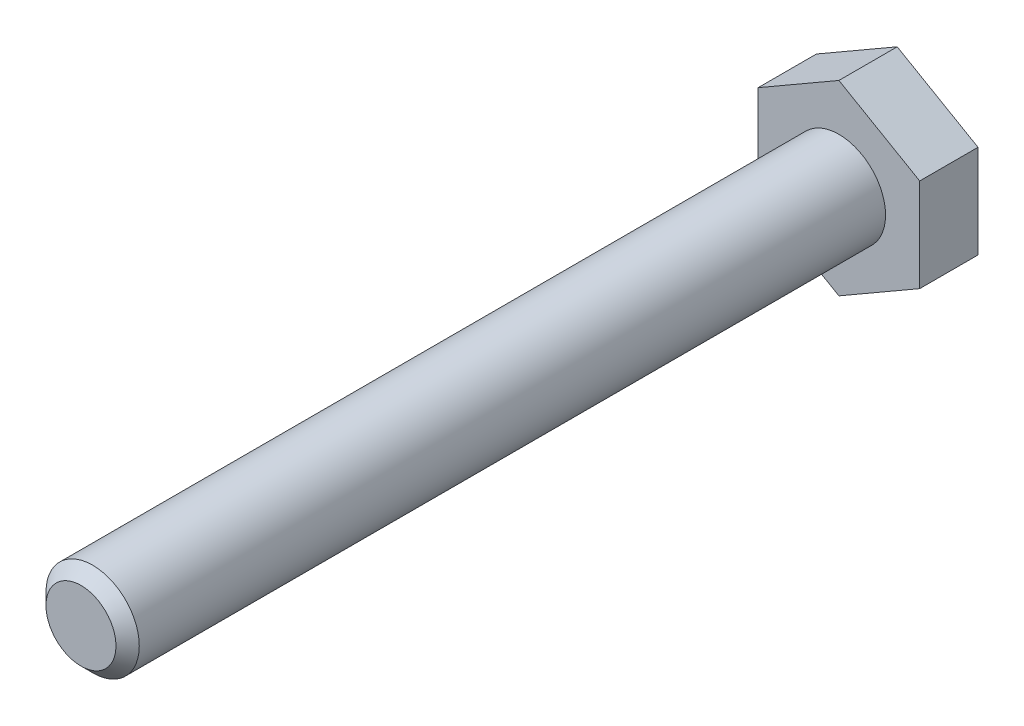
ISO-10303-21;
HEADER;
FILE_DESCRIPTION(('STEP AP214'),'2;1');
FILE_NAME('part.step','',(''),(''),'','','');
FILE_SCHEMA(('AUTOMOTIVE_DESIGN { 1 0 10303 214 1 1 1 1 }'));
ENDSEC;
DATA;
#1=APPLICATION_CONTEXT('core data for automotive mechanical design processes');
#2=APPLICATION_PROTOCOL_DEFINITION('international standard','automotive_design',2000,#1);
#3=PRODUCT_CONTEXT('',#1,'mechanical');
#4=PRODUCT('Part','Part','',(#3));
#5=PRODUCT_RELATED_PRODUCT_CATEGORY('part','',(#4));
#6=PRODUCT_DEFINITION_FORMATION('','',#4);
#7=PRODUCT_DEFINITION_CONTEXT('part definition',#1,'design');
#8=PRODUCT_DEFINITION('design','',#6,#7);
#9=PRODUCT_DEFINITION_SHAPE('','',#8);
#10=(LENGTH_UNIT() NAMED_UNIT(*) SI_UNIT(.MILLI.,.METRE.));
#11=(NAMED_UNIT(*) PLANE_ANGLE_UNIT() SI_UNIT($,.RADIAN.));
#12=(NAMED_UNIT(*) SI_UNIT($,.STERADIAN.) SOLID_ANGLE_UNIT());
#13=UNCERTAINTY_MEASURE_WITH_UNIT(LENGTH_MEASURE(1.E-05),#10,'distance_accuracy_value','');
#14=(GEOMETRIC_REPRESENTATION_CONTEXT(3) GLOBAL_UNCERTAINTY_ASSIGNED_CONTEXT((#13)) GLOBAL_UNIT_ASSIGNED_CONTEXT((#10,
#11,#12)) REPRESENTATION_CONTEXT('',''));
#15=CARTESIAN_POINT('',(0.,0.,0.));
#16=DIRECTION('',(0.,0.,1.));
#17=DIRECTION('',(1.,0.,0.));
#18=AXIS2_PLACEMENT_3D('',#15,#16,#17);
#19=CARTESIAN_POINT('',(6.92820323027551,4.00000000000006,70.));
#20=DIRECTION('',(-0.5,-0.866025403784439,0.));
#21=DIRECTION('',(0.866025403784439,-0.5,0.));
#22=AXIS2_PLACEMENT_3D('',#19,#20,#21);
#23=PLANE('',#22);
#24=DIRECTION('',(-0.866025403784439,0.5,0.));
#25=VECTOR('',#24,1.);
#26=CARTESIAN_POINT('',(6.92820323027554,3.99999999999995,5.00000000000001));
#27=LINE('',#26,#25);
#28=CARTESIAN_POINT('',(6.92820323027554,3.99999999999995,5.00000000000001));
#29=VERTEX_POINT('',#28);
#30=CARTESIAN_POINT('',(0.,8.00000000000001,5.00000000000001));
#31=VERTEX_POINT('',#30);
#32=EDGE_CURVE('E79',#29,#31,#27,.T.);
#33=ORIENTED_EDGE('',*,*,#32,.F.);
#34=DIRECTION('',(0.,0.,-1.));
#35=VECTOR('',#34,1.);
#36=CARTESIAN_POINT('',(6.92820323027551,4.00000000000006,70.));
#37=LINE('',#36,#35);
#38=CARTESIAN_POINT('',(6.92820323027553,3.99999999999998,0.));
#39=VERTEX_POINT('',#38);
#40=EDGE_CURVE('E48',#29,#39,#37,.T.);
#41=ORIENTED_EDGE('',*,*,#40,.T.);
#42=DIRECTION('',(-0.866025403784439,0.5,0.));
#43=VECTOR('',#42,1.);
#44=CARTESIAN_POINT('',(6.92820323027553,3.99999999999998,0.));
#45=LINE('',#44,#43);
#46=CARTESIAN_POINT('',(0.,8.00000000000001,0.));
#47=VERTEX_POINT('',#46);
#48=EDGE_CURVE('E86',#39,#47,#45,.T.);
#49=ORIENTED_EDGE('',*,*,#48,.T.);
#50=DIRECTION('',(0.,0.,-1.));
#51=VECTOR('',#50,1.);
#52=CARTESIAN_POINT('',(0.,8.00000000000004,70.));
#53=LINE('',#52,#51);
#54=EDGE_CURVE('E83',#31,#47,#53,.T.);
#55=ORIENTED_EDGE('',*,*,#54,.F.);
#56=EDGE_LOOP('',(#33,#41,#49,#55));
#57=FACE_BOUND('',#56,.T.);
#58=ADVANCED_FACE('F26',(#57),#23,.F.);
#59=CARTESIAN_POINT('',(0.,8.00000000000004,70.));
#60=DIRECTION('',(0.5,-0.866025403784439,0.));
#61=DIRECTION('',(0.866025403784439,0.5,0.));
#62=AXIS2_PLACEMENT_3D('',#59,#60,#61);
#63=PLANE('',#62);
#64=DIRECTION('',(-0.866025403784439,-0.5,0.));
#65=VECTOR('',#64,1.);
#66=CARTESIAN_POINT('',(0.,8.00000000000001,5.00000000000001));
#67=LINE('',#66,#65);
#68=CARTESIAN_POINT('',(-6.92820323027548,3.99999999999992,5.00000000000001));
#69=VERTEX_POINT('',#68);
#70=EDGE_CURVE('E87',#31,#69,#67,.T.);
#71=ORIENTED_EDGE('',*,*,#70,.F.);
#72=ORIENTED_EDGE('',*,*,#54,.T.);
#73=DIRECTION('',(-0.866025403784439,-0.5,0.));
#74=VECTOR('',#73,1.);
#75=CARTESIAN_POINT('',(0.,8.00000000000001,0.));
#76=LINE('',#75,#74);
#77=CARTESIAN_POINT('',(-6.92820323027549,3.99999999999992,0.));
#78=VERTEX_POINT('',#77);
#79=EDGE_CURVE('E168',#47,#78,#76,.T.);
#80=ORIENTED_EDGE('',*,*,#79,.T.);
#81=DIRECTION('',(0.,0.,-1.));
#82=VECTOR('',#81,1.);
#83=CARTESIAN_POINT('',(-6.92820323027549,3.99999999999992,70.));
#84=LINE('',#83,#82);
#85=EDGE_CURVE('E104',#69,#78,#84,.T.);
#86=ORIENTED_EDGE('',*,*,#85,.F.);
#87=EDGE_LOOP('',(#71,#72,#80,#86));
#88=FACE_BOUND('',#87,.T.);
#89=ADVANCED_FACE('F124',(#88),#63,.F.);
#90=CARTESIAN_POINT('',(-6.92820323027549,3.99999999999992,70.));
#91=DIRECTION('',(1.,0.,0.));
#92=DIRECTION('',(0.,1.,0.));
#93=AXIS2_PLACEMENT_3D('',#90,#91,#92);
#94=PLANE('',#93);
#95=DIRECTION('',(0.,-1.,0.));
#96=VECTOR('',#95,1.);
#97=CARTESIAN_POINT('',(-6.92820323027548,3.99999999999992,5.00000000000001));
#98=LINE('',#97,#96);
#99=CARTESIAN_POINT('',(-6.9282032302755,-4.00000000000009,5.00000000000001));
#100=VERTEX_POINT('',#99);
#101=EDGE_CURVE('E164',#69,#100,#98,.T.);
#102=ORIENTED_EDGE('',*,*,#101,.F.);
#103=ORIENTED_EDGE('',*,*,#85,.T.);
#104=DIRECTION('',(0.,-1.,0.));
#105=VECTOR('',#104,1.);
#106=CARTESIAN_POINT('',(-6.92820323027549,3.99999999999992,0.));
#107=LINE('',#106,#105);
#108=CARTESIAN_POINT('',(-6.92820323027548,-4.,0.));
#109=VERTEX_POINT('',#108);
#110=EDGE_CURVE('E171',#78,#109,#107,.T.);
#111=ORIENTED_EDGE('',*,*,#110,.T.);
#112=DIRECTION('',(0.,0.,-1.));
#113=VECTOR('',#112,1.);
#114=CARTESIAN_POINT('',(-6.92820323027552,-4.00000000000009,70.));
#115=LINE('',#114,#113);
#116=EDGE_CURVE('E102',#100,#109,#115,.T.);
#117=ORIENTED_EDGE('',*,*,#116,.F.);
#118=EDGE_LOOP('',(#102,#103,#111,#117));
#119=FACE_BOUND('',#118,.T.);
#120=ADVANCED_FACE('F129',(#119),#94,.F.);
#121=CARTESIAN_POINT('',(-6.92820323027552,-4.00000000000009,70.));
#122=DIRECTION('',(0.5,0.866025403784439,0.));
#123=DIRECTION('',(-0.866025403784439,0.5,0.));
#124=AXIS2_PLACEMENT_3D('',#121,#122,#123);
#125=PLANE('',#124);
#126=DIRECTION('',(0.866025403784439,-0.5,0.));
#127=VECTOR('',#126,1.);
#128=CARTESIAN_POINT('',(-6.9282032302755,-4.00000000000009,5.00000000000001));
#129=LINE('',#128,#127);
#130=CARTESIAN_POINT('',(0.,-8.00000000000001,5.));
#131=VERTEX_POINT('',#130);
#132=EDGE_CURVE('E160',#100,#131,#129,.T.);
#133=ORIENTED_EDGE('',*,*,#132,.F.);
#134=ORIENTED_EDGE('',*,*,#116,.T.);
#135=DIRECTION('',(0.866025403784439,-0.5,0.));
#136=VECTOR('',#135,1.);
#137=CARTESIAN_POINT('',(-6.92820323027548,-4.,0.));
#138=LINE('',#137,#136);
#139=CARTESIAN_POINT('',(0.,-8.00000000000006,0.));
#140=VERTEX_POINT('',#139);
#141=EDGE_CURVE('E174',#109,#140,#138,.T.);
#142=ORIENTED_EDGE('',*,*,#141,.T.);
#143=DIRECTION('',(0.,0.,-1.));
#144=VECTOR('',#143,1.);
#145=CARTESIAN_POINT('',(0.,-8.00000000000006,70.));
#146=LINE('',#145,#144);
#147=EDGE_CURVE('E95',#131,#140,#146,.T.);
#148=ORIENTED_EDGE('',*,*,#147,.F.);
#149=EDGE_LOOP('',(#133,#134,#142,#148));
#150=FACE_BOUND('',#149,.T.);
#151=ADVANCED_FACE('F134',(#150),#125,.F.);
#152=CARTESIAN_POINT('',(0.,-8.00000000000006,70.));
#153=DIRECTION('',(-0.5,0.866025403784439,0.));
#154=DIRECTION('',(-0.866025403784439,-0.5,0.));
#155=AXIS2_PLACEMENT_3D('',#152,#153,#154);
#156=PLANE('',#155);
#157=DIRECTION('',(0.866025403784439,0.5,0.));
#158=VECTOR('',#157,1.);
#159=CARTESIAN_POINT('',(0.,-8.00000000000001,5.));
#160=LINE('',#159,#158);
#161=CARTESIAN_POINT('',(6.92820323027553,-4.00000000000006,5.));
#162=VERTEX_POINT('',#161);
#163=EDGE_CURVE('E40',#131,#162,#160,.T.);
#164=ORIENTED_EDGE('',*,*,#163,.F.);
#165=ORIENTED_EDGE('',*,*,#147,.T.);
#166=DIRECTION('',(0.866025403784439,0.5,0.));
#167=VECTOR('',#166,1.);
#168=CARTESIAN_POINT('',(0.,-8.00000000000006,0.));
#169=LINE('',#168,#167);
#170=CARTESIAN_POINT('',(6.92820323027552,-4.00000000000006,0.));
#171=VERTEX_POINT('',#170);
#172=EDGE_CURVE('E97',#140,#171,#169,.T.);
#173=ORIENTED_EDGE('',*,*,#172,.T.);
#174=DIRECTION('',(0.,0.,-1.));
#175=VECTOR('',#174,1.);
#176=CARTESIAN_POINT('',(6.92820323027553,-4.00000000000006,70.));
#177=LINE('',#176,#175);
#178=EDGE_CURVE('E93',#162,#171,#177,.T.);
#179=ORIENTED_EDGE('',*,*,#178,.F.);
#180=EDGE_LOOP('',(#164,#165,#173,#179));
#181=FACE_BOUND('',#180,.T.);
#182=ADVANCED_FACE('F140',(#181),#156,.F.);
#183=CARTESIAN_POINT('',(6.92820323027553,-4.00000000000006,70.));
#184=DIRECTION('',(-1.,0.,0.));
#185=DIRECTION('',(0.,-1.,0.));
#186=AXIS2_PLACEMENT_3D('',#183,#184,#185);
#187=PLANE('',#186);
#188=DIRECTION('',(0.,1.,0.));
#189=VECTOR('',#188,1.);
#190=CARTESIAN_POINT('',(6.92820323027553,-4.00000000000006,5.));
#191=LINE('',#190,#189);
#192=EDGE_CURVE('E77',#162,#29,#191,.T.);
#193=ORIENTED_EDGE('',*,*,#192,.F.);
#194=ORIENTED_EDGE('',*,*,#178,.T.);
#195=DIRECTION('',(0.,1.,0.));
#196=VECTOR('',#195,1.);
#197=CARTESIAN_POINT('',(6.92820323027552,-4.00000000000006,0.));
#198=LINE('',#197,#196);
#199=EDGE_CURVE('E91',#171,#39,#198,.T.);
#200=ORIENTED_EDGE('',*,*,#199,.T.);
#201=ORIENTED_EDGE('',*,*,#40,.F.);
#202=EDGE_LOOP('',(#193,#194,#200,#201));
#203=FACE_BOUND('',#202,.T.);
#204=ADVANCED_FACE('F89',(#203),#187,.F.);
#205=CARTESIAN_POINT('',(6.92820323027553,3.99999999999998,0.));
#206=DIRECTION('',(0.,0.,-1.));
#207=DIRECTION('',(-1.,0.,0.));
#208=AXIS2_PLACEMENT_3D('',#205,#206,#207);
#209=PLANE('',#208);
#210=ORIENTED_EDGE('',*,*,#48,.F.);
#211=ORIENTED_EDGE('',*,*,#199,.F.);
#212=ORIENTED_EDGE('',*,*,#172,.F.);
#213=ORIENTED_EDGE('',*,*,#141,.F.);
#214=ORIENTED_EDGE('',*,*,#110,.F.);
#215=ORIENTED_EDGE('',*,*,#79,.F.);
#216=EDGE_LOOP('',(#210,#211,#212,#213,#214,#215));
#217=FACE_BOUND('',#216,.T.);
#218=ADVANCED_FACE('F146',(#217),#209,.T.);
#219=CARTESIAN_POINT('',(0.,0.,5.00000000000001));
#220=DIRECTION('',(0.,0.,1.));
#221=DIRECTION('',(1.,0.,0.));
#222=AXIS2_PLACEMENT_3D('',#219,#220,#221);
#223=PLANE('',#222);
#224=CARTESIAN_POINT('',(0.,0.,5.00000000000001));
#225=DIRECTION('',(0.,0.,1.));
#226=DIRECTION('',(1.,0.,0.));
#227=AXIS2_PLACEMENT_3D('',#224,#225,#226);
#228=CIRCLE('',#227,4.);
#229=CARTESIAN_POINT('',(4.,0.,5.00000000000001));
#230=VERTEX_POINT('',#229);
#231=EDGE_CURVE('E158',#230,#230,#228,.T.);
#232=ORIENTED_EDGE('',*,*,#231,.F.);
#233=EDGE_LOOP('',(#232));
#234=FACE_BOUND('',#233,.T.);
#235=ORIENTED_EDGE('',*,*,#32,.T.);
#236=ORIENTED_EDGE('',*,*,#70,.T.);
#237=ORIENTED_EDGE('',*,*,#101,.T.);
#238=ORIENTED_EDGE('',*,*,#132,.T.);
#239=ORIENTED_EDGE('',*,*,#163,.T.);
#240=ORIENTED_EDGE('',*,*,#192,.T.);
#241=EDGE_LOOP('',(#235,#236,#237,#238,#239,#240));
#242=FACE_BOUND('',#241,.T.);
#243=ADVANCED_FACE('F78',(#234,#242),#223,.T.);
#244=CARTESIAN_POINT('',(0.,0.,5.00000000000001));
#245=DIRECTION('',(0.,0.,1.));
#246=DIRECTION('',(1.,0.,0.));
#247=AXIS2_PLACEMENT_3D('',#244,#245,#246);
#248=CYLINDRICAL_SURFACE('',#247,4.);
#249=CARTESIAN_POINT('',(0.,0.,69.));
#250=DIRECTION('',(0.,0.,-1.));
#251=DIRECTION('',(-1.,0.,0.));
#252=AXIS2_PLACEMENT_3D('',#249,#250,#251);
#253=CIRCLE('',#252,4.);
#254=CARTESIAN_POINT('',(-4.00000000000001,0.,69.));
#255=VERTEX_POINT('',#254);
#256=EDGE_CURVE('E11',#255,#255,#253,.T.);
#257=ORIENTED_EDGE('',*,*,#256,.T.);
#258=EDGE_LOOP('',(#257));
#259=FACE_BOUND('',#258,.T.);
#260=ORIENTED_EDGE('',*,*,#231,.T.);
#261=EDGE_LOOP('',(#260));
#262=FACE_BOUND('',#261,.T.);
#263=ADVANCED_FACE('F119',(#259,#262),#248,.T.);
#264=CARTESIAN_POINT('',(6.92820323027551,4.00000000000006,70.));
#265=DIRECTION('',(0.,0.,-1.));
#266=DIRECTION('',(-1.,0.,0.));
#267=AXIS2_PLACEMENT_3D('',#264,#265,#266);
#268=PLANE('',#267);
#269=CARTESIAN_POINT('',(0.,0.,70.));
#270=DIRECTION('',(0.,0.,-1.));
#271=DIRECTION('',(-1.,0.,0.));
#272=AXIS2_PLACEMENT_3D('',#269,#270,#271);
#273=CIRCLE('',#272,2.99999999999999);
#274=CARTESIAN_POINT('',(-3.,0.,70.));
#275=VERTEX_POINT('',#274);
#276=EDGE_CURVE('E33',#275,#275,#273,.F.);
#277=ORIENTED_EDGE('',*,*,#276,.T.);
#278=EDGE_LOOP('',(#277));
#279=FACE_BOUND('',#278,.T.);
#280=ADVANCED_FACE('F109',(#279),#268,.F.);
#281=CARTESIAN_POINT('',(0.,0.,70.));
#282=DIRECTION('',(0.,0.,-1.));
#283=DIRECTION('',(-1.,0.,0.));
#284=AXIS2_PLACEMENT_3D('',#281,#282,#283);
#285=CONICAL_SURFACE('',#284,2.99999999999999,0.785398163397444);
#286=ORIENTED_EDGE('',*,*,#256,.F.);
#287=EDGE_LOOP('',(#286));
#288=FACE_BOUND('',#287,.T.);
#289=ORIENTED_EDGE('',*,*,#276,.F.);
#290=EDGE_LOOP('',(#289));
#291=FACE_BOUND('',#290,.T.);
#292=ADVANCED_FACE('F111',(#288,#291),#285,.T.);
#293=CLOSED_SHELL('',(#58,#89,#120,#151,#182,#204,#218,#243,#263,#280,#292));
#294=MANIFOLD_SOLID_BREP('B2',#293);
#295=ADVANCED_BREP_SHAPE_REPRESENTATION('',(#18,#294),#14);
#296=SHAPE_DEFINITION_REPRESENTATION(#9,#295);
ENDSEC;
END-ISO-10303-21;
